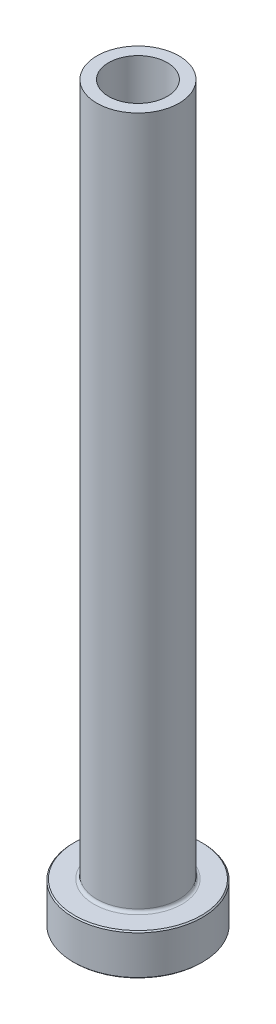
ISO-10303-21;
HEADER;
FILE_DESCRIPTION(('STEP AP214'),'2;1');
FILE_NAME('part.step','',(''),(''),'','','');
FILE_SCHEMA(('AUTOMOTIVE_DESIGN { 1 0 10303 214 1 1 1 1 }'));
ENDSEC;
DATA;
#1=APPLICATION_CONTEXT('core data for automotive mechanical design processes');
#2=APPLICATION_PROTOCOL_DEFINITION('international standard','automotive_design',2000,#1);
#3=PRODUCT_CONTEXT('',#1,'mechanical');
#4=PRODUCT('Part','Part','',(#3));
#5=PRODUCT_RELATED_PRODUCT_CATEGORY('part','',(#4));
#6=PRODUCT_DEFINITION_FORMATION('','',#4);
#7=PRODUCT_DEFINITION_CONTEXT('part definition',#1,'design');
#8=PRODUCT_DEFINITION('design','',#6,#7);
#9=PRODUCT_DEFINITION_SHAPE('','',#8);
#10=(LENGTH_UNIT() NAMED_UNIT(*) SI_UNIT(.MILLI.,.METRE.));
#11=(NAMED_UNIT(*) PLANE_ANGLE_UNIT() SI_UNIT($,.RADIAN.));
#12=(NAMED_UNIT(*) SI_UNIT($,.STERADIAN.) SOLID_ANGLE_UNIT());
#13=UNCERTAINTY_MEASURE_WITH_UNIT(LENGTH_MEASURE(1.E-05),#10,'distance_accuracy_value','');
#14=(GEOMETRIC_REPRESENTATION_CONTEXT(3) GLOBAL_UNCERTAINTY_ASSIGNED_CONTEXT((#13)) GLOBAL_UNIT_ASSIGNED_CONTEXT((#10,
#11,#12)) REPRESENTATION_CONTEXT('',''));
#15=CARTESIAN_POINT('',(0.,0.,0.));
#16=DIRECTION('',(0.,0.,1.));
#17=DIRECTION('',(1.,0.,0.));
#18=AXIS2_PLACEMENT_3D('',#15,#16,#17);
#19=CARTESIAN_POINT('',(0.,92.1876809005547,0.));
#20=DIRECTION('',(0.,1.,0.));
#21=DIRECTION('',(0.,0.,1.));
#22=AXIS2_PLACEMENT_3D('',#19,#20,#21);
#23=CYLINDRICAL_SURFACE('',#22,5.);
#24=CARTESIAN_POINT('',(0.,125.,0.));
#25=DIRECTION('',(0.,1.,0.));
#26=DIRECTION('',(0.,0.,1.));
#27=AXIS2_PLACEMENT_3D('',#24,#25,#26);
#28=CIRCLE('',#27,5.);
#29=CARTESIAN_POINT('',(0.,125.,5.));
#30=VERTEX_POINT('',#29);
#31=EDGE_CURVE('E62',#30,#30,#28,.T.);
#32=ORIENTED_EDGE('',*,*,#31,.T.);
#33=EDGE_LOOP('',(#32));
#34=FACE_BOUND('',#33,.T.);
#35=CARTESIAN_POINT('',(0.,80.,0.));
#36=DIRECTION('',(0.,1.,0.));
#37=DIRECTION('',(0.,0.,1.));
#38=AXIS2_PLACEMENT_3D('',#35,#36,#37);
#39=CIRCLE('',#38,5.);
#40=CARTESIAN_POINT('',(0.,80.,5.));
#41=VERTEX_POINT('',#40);
#42=EDGE_CURVE('E71',#41,#41,#39,.T.);
#43=ORIENTED_EDGE('',*,*,#42,.F.);
#44=EDGE_LOOP('',(#43));
#45=FACE_BOUND('',#44,.T.);
#46=ADVANCED_FACE('F30',(#34,#45),#23,.F.);
#47=CARTESIAN_POINT('',(-5.,125.,0.));
#48=DIRECTION('',(0.,1.,0.));
#49=DIRECTION('',(0.,0.,1.));
#50=AXIS2_PLACEMENT_3D('',#47,#48,#49);
#51=PLANE('',#50);
#52=CARTESIAN_POINT('',(0.,125.,0.));
#53=DIRECTION('',(0.,1.,0.));
#54=DIRECTION('',(0.,0.,1.));
#55=AXIS2_PLACEMENT_3D('',#52,#53,#54);
#56=CIRCLE('',#55,7.);
#57=CARTESIAN_POINT('',(0.,125.,7.));
#58=VERTEX_POINT('',#57);
#59=EDGE_CURVE('E65',#58,#58,#56,.T.);
#60=ORIENTED_EDGE('',*,*,#59,.T.);
#61=EDGE_LOOP('',(#60));
#62=FACE_BOUND('',#61,.T.);
#63=ORIENTED_EDGE('',*,*,#31,.F.);
#64=EDGE_LOOP('',(#63));
#65=FACE_BOUND('',#64,.T.);
#66=ADVANCED_FACE('F79',(#62,#65),#51,.T.);
#67=CARTESIAN_POINT('',(0.,92.1876809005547,0.));
#68=DIRECTION('',(0.,1.,0.));
#69=DIRECTION('',(0.,0.,1.));
#70=AXIS2_PLACEMENT_3D('',#67,#68,#69);
#71=CYLINDRICAL_SURFACE('',#70,7.);
#72=CARTESIAN_POINT('',(0.,7.50000000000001,0.));
#73=DIRECTION('',(0.,1.,0.));
#74=DIRECTION('',(0.,0.,1.));
#75=AXIS2_PLACEMENT_3D('',#72,#73,#74);
#76=CIRCLE('',#75,7.);
#77=CARTESIAN_POINT('',(0.,7.50000000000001,7.));
#78=VERTEX_POINT('',#77);
#79=EDGE_CURVE('E59',#78,#78,#76,.T.);
#80=ORIENTED_EDGE('',*,*,#79,.T.);
#81=EDGE_LOOP('',(#80));
#82=FACE_BOUND('',#81,.T.);
#83=ORIENTED_EDGE('',*,*,#59,.F.);
#84=EDGE_LOOP('',(#83));
#85=FACE_BOUND('',#84,.T.);
#86=ADVANCED_FACE('F85',(#82,#85),#71,.T.);
#87=CARTESIAN_POINT('',(-6.99999999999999,7.,0.));
#88=DIRECTION('',(0.,1.,0.));
#89=DIRECTION('',(0.,0.,1.));
#90=AXIS2_PLACEMENT_3D('',#87,#88,#89);
#91=PLANE('',#90);
#92=CARTESIAN_POINT('',(0.,7.,0.));
#93=DIRECTION('',(0.,1.,0.));
#94=DIRECTION('',(0.,0.,1.));
#95=AXIS2_PLACEMENT_3D('',#92,#93,#94);
#96=CIRCLE('',#95,10.8);
#97=CARTESIAN_POINT('',(0.,7.,10.8));
#98=VERTEX_POINT('',#97);
#99=EDGE_CURVE('E53',#98,#98,#96,.T.);
#100=ORIENTED_EDGE('',*,*,#99,.T.);
#101=EDGE_LOOP('',(#100));
#102=FACE_BOUND('',#101,.T.);
#103=CARTESIAN_POINT('',(0.,7.,0.));
#104=DIRECTION('',(0.,1.,0.));
#105=DIRECTION('',(0.,0.,1.));
#106=AXIS2_PLACEMENT_3D('',#103,#104,#105);
#107=CIRCLE('',#106,7.5);
#108=CARTESIAN_POINT('',(0.,7.,7.5));
#109=VERTEX_POINT('',#108);
#110=EDGE_CURVE('E56',#109,#109,#107,.F.);
#111=ORIENTED_EDGE('',*,*,#110,.T.);
#112=EDGE_LOOP('',(#111));
#113=FACE_BOUND('',#112,.T.);
#114=ADVANCED_FACE('F111',(#102,#113),#91,.T.);
#115=CARTESIAN_POINT('',(0.,92.1876809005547,0.));
#116=DIRECTION('',(0.,1.,0.));
#117=DIRECTION('',(0.,0.,1.));
#118=AXIS2_PLACEMENT_3D('',#115,#116,#117);
#119=CYLINDRICAL_SURFACE('',#118,11.);
#120=CARTESIAN_POINT('',(0.,6.80000000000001,0.));
#121=DIRECTION('',(0.,1.,0.));
#122=DIRECTION('',(0.,0.,1.));
#123=AXIS2_PLACEMENT_3D('',#120,#121,#122);
#124=CIRCLE('',#123,11.);
#125=CARTESIAN_POINT('',(0.,6.80000000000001,11.));
#126=VERTEX_POINT('',#125);
#127=EDGE_CURVE('E45',#126,#126,#124,.F.);
#128=ORIENTED_EDGE('',*,*,#127,.T.);
#129=EDGE_LOOP('',(#128));
#130=FACE_BOUND('',#129,.T.);
#131=CARTESIAN_POINT('',(0.,0.20000000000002,0.));
#132=DIRECTION('',(0.,-1.,0.));
#133=DIRECTION('',(0.,0.,-1.));
#134=AXIS2_PLACEMENT_3D('',#131,#132,#133);
#135=CIRCLE('',#134,11.);
#136=CARTESIAN_POINT('',(0.,0.20000000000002,-11.));
#137=VERTEX_POINT('',#136);
#138=EDGE_CURVE('E50',#137,#137,#135,.F.);
#139=ORIENTED_EDGE('',*,*,#138,.T.);
#140=EDGE_LOOP('',(#139));
#141=FACE_BOUND('',#140,.T.);
#142=ADVANCED_FACE('F108',(#130,#141),#119,.T.);
#143=CARTESIAN_POINT('',(-11.,0.,0.));
#144=DIRECTION('',(0.,-1.,0.));
#145=DIRECTION('',(0.,0.,-1.));
#146=AXIS2_PLACEMENT_3D('',#143,#144,#145);
#147=PLANE('',#146);
#148=CARTESIAN_POINT('',(0.,0.,0.));
#149=DIRECTION('',(0.,-1.,0.));
#150=DIRECTION('',(0.,0.,-1.));
#151=AXIS2_PLACEMENT_3D('',#148,#149,#150);
#152=CIRCLE('',#151,5.74999999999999);
#153=CARTESIAN_POINT('',(0.,0.,-5.74999999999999));
#154=VERTEX_POINT('',#153);
#155=EDGE_CURVE('E37',#154,#154,#152,.F.);
#156=ORIENTED_EDGE('',*,*,#155,.T.);
#157=EDGE_LOOP('',(#156));
#158=FACE_BOUND('',#157,.T.);
#159=CARTESIAN_POINT('',(0.,0.,0.));
#160=DIRECTION('',(0.,-1.,0.));
#161=DIRECTION('',(0.,0.,-1.));
#162=AXIS2_PLACEMENT_3D('',#159,#160,#161);
#163=CIRCLE('',#162,10.8);
#164=CARTESIAN_POINT('',(0.,0.,-10.8));
#165=VERTEX_POINT('',#164);
#166=EDGE_CURVE('E41',#165,#165,#163,.T.);
#167=ORIENTED_EDGE('',*,*,#166,.T.);
#168=EDGE_LOOP('',(#167));
#169=FACE_BOUND('',#168,.T.);
#170=ADVANCED_FACE('F110',(#158,#169),#147,.T.);
#171=CARTESIAN_POINT('',(0.,92.1876809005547,0.));
#172=DIRECTION('',(0.,1.,0.));
#173=DIRECTION('',(0.,0.,1.));
#174=AXIS2_PLACEMENT_3D('',#171,#172,#173);
#175=CYLINDRICAL_SURFACE('',#174,5.25);
#176=CARTESIAN_POINT('',(0.,0.5,0.));
#177=DIRECTION('',(0.,-1.,0.));
#178=DIRECTION('',(0.,0.,-1.));
#179=AXIS2_PLACEMENT_3D('',#176,#177,#178);
#180=CIRCLE('',#179,5.25);
#181=CARTESIAN_POINT('',(0.,0.5,-5.25));
#182=VERTEX_POINT('',#181);
#183=EDGE_CURVE('E10',#182,#182,#180,.T.);
#184=ORIENTED_EDGE('',*,*,#183,.T.);
#185=EDGE_LOOP('',(#184));
#186=FACE_BOUND('',#185,.T.);
#187=CARTESIAN_POINT('',(0.,68.,0.));
#188=DIRECTION('',(0.,1.,0.));
#189=DIRECTION('',(0.,0.,1.));
#190=AXIS2_PLACEMENT_3D('',#187,#188,#189);
#191=CIRCLE('',#190,5.25);
#192=CARTESIAN_POINT('',(0.,68.,5.25));
#193=VERTEX_POINT('',#192);
#194=EDGE_CURVE('E68',#193,#193,#191,.T.);
#195=ORIENTED_EDGE('',*,*,#194,.T.);
#196=EDGE_LOOP('',(#195));
#197=FACE_BOUND('',#196,.T.);
#198=ADVANCED_FACE('F118',(#186,#197),#175,.F.);
#199=CARTESIAN_POINT('',(0.,68.,0.));
#200=DIRECTION('',(0.,-1.,0.));
#201=DIRECTION('',(0.,0.,-1.));
#202=AXIS2_PLACEMENT_3D('',#199,#200,#201);
#203=CONICAL_SURFACE('',#202,5.25,0.0208303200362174);
#204=ORIENTED_EDGE('',*,*,#42,.T.);
#205=EDGE_LOOP('',(#204));
#206=FACE_BOUND('',#205,.T.);
#207=ORIENTED_EDGE('',*,*,#194,.F.);
#208=EDGE_LOOP('',(#207));
#209=FACE_BOUND('',#208,.T.);
#210=ADVANCED_FACE('F75',(#206,#209),#203,.F.);
#211=CARTESIAN_POINT('',(0.,7.50000000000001,0.));
#212=DIRECTION('',(0.,1.,0.));
#213=DIRECTION('',(0.,0.,1.));
#214=AXIS2_PLACEMENT_3D('',#211,#212,#213);
#215=TOROIDAL_SURFACE('',#214,7.5,0.5);
#216=ORIENTED_EDGE('',*,*,#110,.F.);
#217=EDGE_LOOP('',(#216));
#218=FACE_BOUND('',#217,.T.);
#219=ORIENTED_EDGE('',*,*,#79,.F.);
#220=EDGE_LOOP('',(#219));
#221=FACE_BOUND('',#220,.T.);
#222=ADVANCED_FACE('F90',(#218,#221),#215,.F.);
#223=CARTESIAN_POINT('',(0.,7.00000000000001,0.));
#224=DIRECTION('',(0.,-1.,0.));
#225=DIRECTION('',(0.,0.,-1.));
#226=AXIS2_PLACEMENT_3D('',#223,#224,#225);
#227=CONICAL_SURFACE('',#226,10.8,0.785398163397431);
#228=ORIENTED_EDGE('',*,*,#127,.F.);
#229=EDGE_LOOP('',(#228));
#230=FACE_BOUND('',#229,.T.);
#231=ORIENTED_EDGE('',*,*,#99,.F.);
#232=EDGE_LOOP('',(#231));
#233=FACE_BOUND('',#232,.T.);
#234=ADVANCED_FACE('F93',(#230,#233),#227,.T.);
#235=CARTESIAN_POINT('',(0.,0.20000000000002,0.));
#236=DIRECTION('',(0.,1.,0.));
#237=DIRECTION('',(0.,0.,1.));
#238=AXIS2_PLACEMENT_3D('',#235,#236,#237);
#239=CONICAL_SURFACE('',#238,11.,0.785398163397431);
#240=ORIENTED_EDGE('',*,*,#166,.F.);
#241=EDGE_LOOP('',(#240));
#242=FACE_BOUND('',#241,.T.);
#243=ORIENTED_EDGE('',*,*,#138,.F.);
#244=EDGE_LOOP('',(#243));
#245=FACE_BOUND('',#244,.T.);
#246=ADVANCED_FACE('F96',(#242,#245),#239,.T.);
#247=CARTESIAN_POINT('',(0.,0.,0.));
#248=DIRECTION('',(0.,-1.,0.));
#249=DIRECTION('',(0.,0.,-1.));
#250=AXIS2_PLACEMENT_3D('',#247,#248,#249);
#251=CONICAL_SURFACE('',#250,5.74999999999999,0.785398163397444);
#252=ORIENTED_EDGE('',*,*,#183,.F.);
#253=EDGE_LOOP('',(#252));
#254=FACE_BOUND('',#253,.T.);
#255=ORIENTED_EDGE('',*,*,#155,.F.);
#256=EDGE_LOOP('',(#255));
#257=FACE_BOUND('',#256,.T.);
#258=ADVANCED_FACE('F32',(#254,#257),#251,.F.);
#259=CLOSED_SHELL('',(#46,#66,#86,#114,#142,#170,#198,#210,#222,#234,#246,#258));
#260=MANIFOLD_SOLID_BREP('B2',#259);
#261=ADVANCED_BREP_SHAPE_REPRESENTATION('',(#18,#260),#14);
#262=SHAPE_DEFINITION_REPRESENTATION(#9,#261);
ENDSEC;
END-ISO-10303-21;
